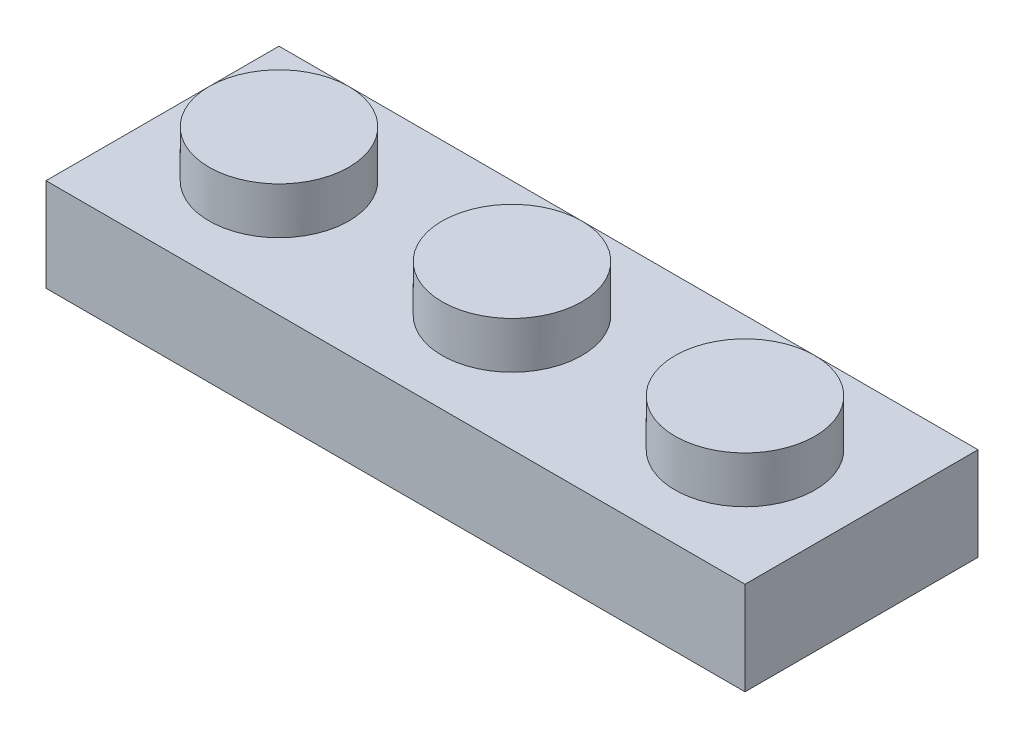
from build123d import *

# Parameters (mm, degrees)
SKETCH1_W           = 48
SKETCH1_H           = 8
BOSS_EXTRUDE1_DEPTH = 3.2
SKETCH2_R           = 2.4
BOSS_EXTRUDE2_DEPTH = 1.6
SHELL1_T            = -1.6
SKETCH3_R           = 1.769647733
BOSS_EXTRUDE3_DEPTH = 1.6
SKETCH4_W           = 8
SKETCH4_H           = 4.866297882
CUT_EXTRUDE1_DEPTH  = 25.8
SKETCH5_W           = 8
SKETCH5_H           = 2.05
BOSS_EXTRUDE4_DEPTH = 1.6
SKETCH6_W           = 4.8
SKETCH6_H           = 1.6
CUT_EXTRUDE2_DEPTH  = 1.6


with BuildPart() as part:
    # Sketch1 → Boss-Extrude1 (new body)
    with BuildSketch(Plane(origin=(0, 0, 0), x_dir=(1, 0, 0), z_dir=(0, 1, 0))):
        Rectangle(SKETCH1_W, SKETCH1_H)
    extrude(amount=BOSS_EXTRUDE1_DEPTH)

    # Sketch2 → Boss-Extrude2 (add)
    with BuildSketch(Plane(origin=(0, 3.2, 0), x_dir=(1, 0, 0), z_dir=(0, 1, 0))):
        with Locations(Location((-20, 0, 0), (0, 0, 90))):
            Circle(SKETCH2_R)
        with Locations(Location((-12, 0, 0), (0, 0, 90))):
            Circle(SKETCH2_R)
        with Locations(Location((-4, 0, 0), (0, 0, 90))):
            Circle(SKETCH2_R)
        with Locations(Location((4, 0, 0), (0, 0, 90))):
            Circle(SKETCH2_R)
        with Locations(Location((12, 0, 0), (0, 0, 90))):
            Circle(SKETCH2_R)
        with Locations(Location((20, 0, 0), (0, 0, 90))):
            Circle(SKETCH2_R)
    extrude(amount=BOSS_EXTRUDE2_DEPTH)

    # Shell1
    shell1_openings = [part.faces().sort_by_distance(p)[0] for p in [
        (0, 0, 0),
    ]]
    offset(amount=SHELL1_T, openings=shell1_openings, kind=Kind.INTERSECTION)

    # Sketch3 → Boss-Extrude3 (add)
    with BuildSketch(Plane.XZ.offset(-1.6)):
        with Locations(Location((0, 0, 0), (0, 0, 270))):
            Circle(SKETCH3_R)
        with Locations(Location((8, 0, 0), (0, 0, 270))):
            Circle(SKETCH3_R)
        with Locations(Location((16, 0, 0), (0, 0, 270))):
            Circle(SKETCH3_R)
        with Locations(Location((-8, 0, 0), (0, 0, 270))):
            Circle(SKETCH3_R)
        with Locations(Location((-16, 0, 0), (0, 0, 270))):
            Circle(SKETCH3_R)
    extrude(amount=BOSS_EXTRUDE3_DEPTH)

    # Sketch4 → Cut-Extrude1 (cut, through all)
    with BuildSketch(Plane(origin=(0, 0, 0), x_dir=(0, 0, -1), z_dir=(1, 0, 0))):
        with Locations((0, 2.433148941)):
            Rectangle(SKETCH4_W, SKETCH4_H)
    extrude(amount=CUT_EXTRUDE1_DEPTH, mode=Mode.SUBTRACT)

    # Sketch5 → Boss-Extrude4 (add)
    with BuildSketch(Plane(origin=(0, 0, 0), x_dir=(0, 0, -1), z_dir=(1, 0, 0))):
        with Locations((0, 1.025)):
            Rectangle(SKETCH5_W, SKETCH5_H)
    extrude(amount=-BOSS_EXTRUDE4_DEPTH)

    # Sketch6 → Cut-Extrude2 (cut)
    with BuildSketch(Plane.ZY.offset(1.6)):
        with Locations((0, 0.8)):
            Rectangle(SKETCH6_W, SKETCH6_H)
    extrude(amount=CUT_EXTRUDE2_DEPTH, mode=Mode.SUBTRACT)


solid = part.part
